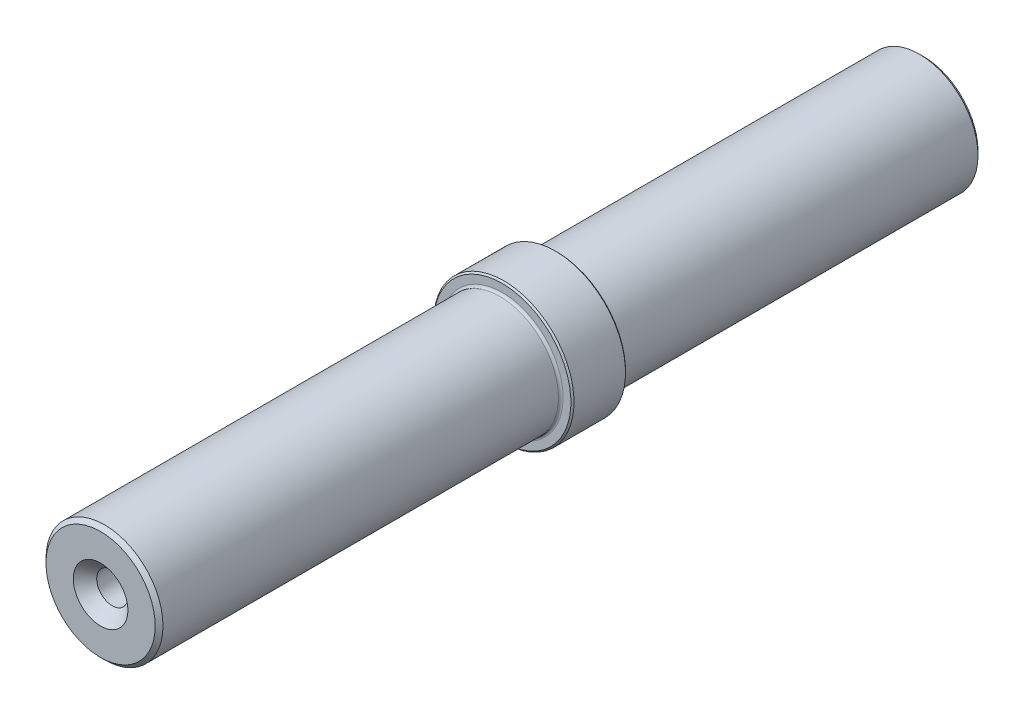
from build123d import *

# Parameters (mm, degrees)
SKETCH_1_R                      = 7.5
EXTRUDE_1_DEPTH                 = 105.5
SKETCH_3_R                      = 9
EXTRUDE_3_DEPTH                 = 7
HOLE_WIZARD_M5_1_D              = 4.2
HOLE_WIZARD_M5_1_DEPTH          = 12.4
HOLE_WIZARD_M5_1_CSINK_D        = 5.05
HOLE_WIZARD_M5_1_CSINK_ANGLE    = 90
HOLE_WIZARD_M5_1_TIP            = 1.2618073
HOLE_WIZARD_4_0_4_1_D           = 4
HOLE_WIZARD_4_0_4_1_DEPTH       = 15
HOLE_WIZARD_4_0_4_1_CSINK_D     = 7
HOLE_WIZARD_4_0_4_1_CSINK_ANGLE = 90
HOLE_WIZARD_4_0_4_1_TIP         = 1.201721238
CHAMFER_2_SIZE                  = 0.5
FILLET_1_R                      = 0.3
CHAMFER_3_SIZE                  = 0.2


with BuildPart() as part:
    # Sketch 1 → Extrude 1 (new body)
    with BuildSketch(Plane.XY):
        Circle(SKETCH_1_R)
    extrude(amount=EXTRUDE_1_DEPTH)

    # Sketch 3 → Extrude 3 (add)
    with BuildSketch(Plane(origin=(0, 0, 47), x_dir=(-1, 0, 0), z_dir=(0, 0, -1))):
        Circle(SKETCH_3_R)
    extrude(amount=-EXTRUDE_3_DEPTH)

    # Hole Wizard M5 _1
    with Locations(Plane(origin=(0, 0, 0), x_dir=(-1, 0, 0), z_dir=(0, 0, -1))):
        with Locations((0, 0)):
            CounterSinkHole(HOLE_WIZARD_M5_1_D / 2, HOLE_WIZARD_M5_1_CSINK_D / 2, depth=HOLE_WIZARD_M5_1_DEPTH, counter_sink_angle=HOLE_WIZARD_M5_1_CSINK_ANGLE)
            with Locations((0, 0, -(HOLE_WIZARD_M5_1_DEPTH + HOLE_WIZARD_M5_1_TIP / 2))):  # 118° drill point
                Cone(0, HOLE_WIZARD_M5_1_D / 2, HOLE_WIZARD_M5_1_TIP, mode=Mode.SUBTRACT)

    # Hole Wizard 4.0 _4_ _1
    with Locations(Plane.XY.offset(105.5)):
        with Locations((0, 0)):
            CounterSinkHole(HOLE_WIZARD_4_0_4_1_D / 2, HOLE_WIZARD_4_0_4_1_CSINK_D / 2, depth=HOLE_WIZARD_4_0_4_1_DEPTH, counter_sink_angle=HOLE_WIZARD_4_0_4_1_CSINK_ANGLE)
            with Locations((0, 0, -(HOLE_WIZARD_4_0_4_1_DEPTH + HOLE_WIZARD_4_0_4_1_TIP / 2))):  # 118° drill point
                Cone(0, HOLE_WIZARD_4_0_4_1_D / 2, HOLE_WIZARD_4_0_4_1_TIP, mode=Mode.SUBTRACT)

    # Chamfer 2
    chamfer_2_edges = [part.edges().sort_by_distance(p)[0] for p in [
        (-7.5, 0, 0),
        (-7.5, 0, 105.5),
    ]]
    chamfer(chamfer_2_edges, length=CHAMFER_2_SIZE)

    # Fillet 1
    fillet_1_edges = [part.edges().sort_by_distance(p)[0] for p in [
        (-7.5, 0, 54),
        (-7.5, 0, 47),
    ]]
    fillet(fillet_1_edges, radius=FILLET_1_R)

    # Chamfer 3
    chamfer_3_edges = [part.edges().sort_by_distance(p)[0] for p in [
        (9, 0, 54),
        (9, 0, 47),
    ]]
    chamfer(chamfer_3_edges, length=CHAMFER_3_SIZE)


solid = part.part
